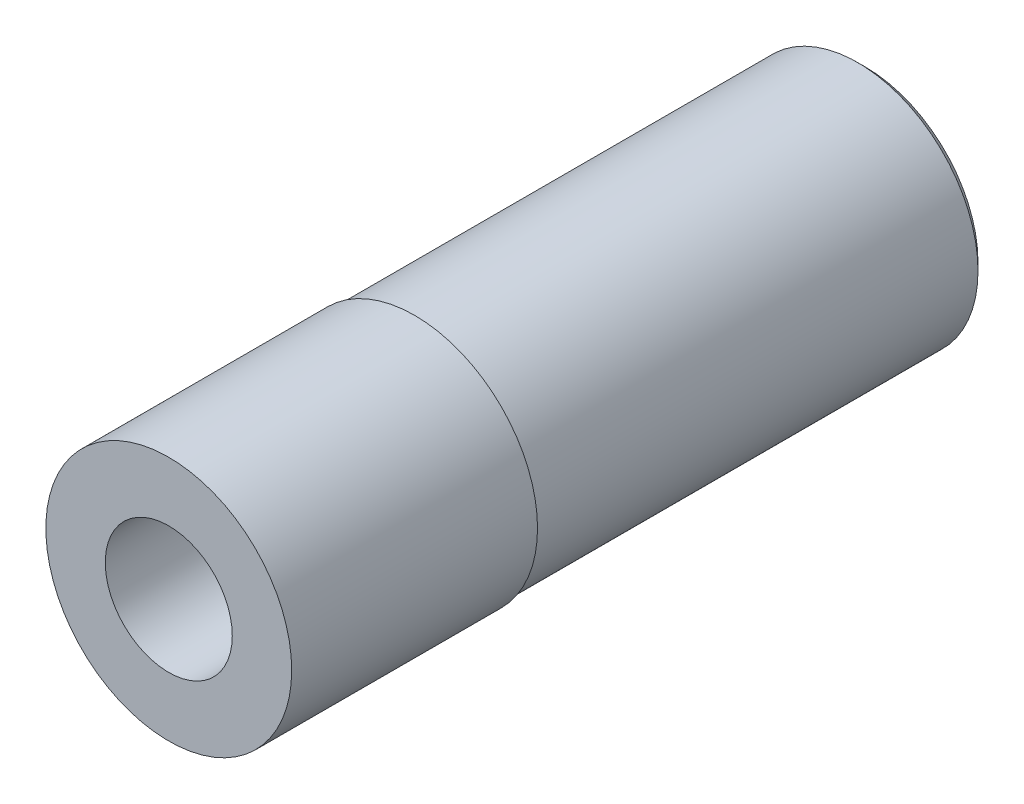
from build123d import *

# Parameters (mm, degrees)
SKETCH4_W          = 11
SKETCH4_H          = 1
CUT_EXTRUDE2_DEPTH = 1.4


with BuildPart() as part:
    # Sketch1 → Revolve1 (revolve)
    with BuildSketch(Plane(origin=(0, 0, 0), x_dir=(0, 0, -1), z_dir=(1, 0, 0)), mode=Mode.PRIVATE) as revolve1_sk:
        Polygon((0, 3), (0, 1.55), (2.8, 1.55), (2.8, 0.8), (14, 0.8), (14, 1.5), (17, 1.5), (17, 2.75), (16.75, 3), align=None)
    revolve(revolve1_sk.sketch.rotate(Axis((0, 0, 3.797909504), (0, 0, -1)), 90), axis=Axis((0, 0, 3.797909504), (0, 0, -1)))

    # Sketch4 → Cut-Revolve1 (revolve, cut)
    with BuildSketch(Plane(origin=(0, 0, 0), x_dir=(0, 0, -1), z_dir=(1, 0, 0)), mode=Mode.PRIVATE) as cut_revolve1_sk:
        with Locations((11.5, 3.435)):
            Rectangle(SKETCH4_W, SKETCH4_H)
    revolve(cut_revolve1_sk.sketch.rotate(Axis((0, 0, 0), (0, 0, -1)), 90), axis=Axis((0, 0, 0), (0, 0, -1)), mode=Mode.SUBTRACT)

    # Sketch3 → Cut-Extrude2 (cut)
    with BuildSketch(Plane.XY.offset(-2.8)):
        Polygon((0.461880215, 0.8), (-0.461880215, 0.8), (-0.923760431, 0), (-0.461880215, -0.8), (0.461880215, -0.8), (0.923760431, 0), align=None)
    extrude(amount=-CUT_EXTRUDE2_DEPTH, mode=Mode.SUBTRACT)


solid = part.part
